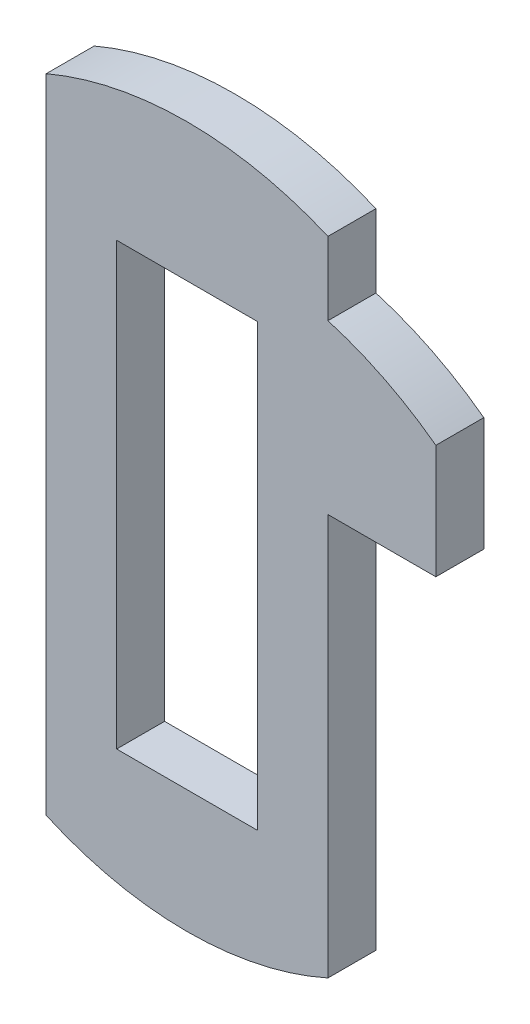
ISO-10303-21;
HEADER;
FILE_DESCRIPTION(('STEP AP214'),'2;1');
FILE_NAME('part.step','',(''),(''),'','','');
FILE_SCHEMA(('AUTOMOTIVE_DESIGN { 1 0 10303 214 1 1 1 1 }'));
ENDSEC;
DATA;
#1=APPLICATION_CONTEXT('core data for automotive mechanical design processes');
#2=APPLICATION_PROTOCOL_DEFINITION('international standard','automotive_design',2000,#1);
#3=PRODUCT_CONTEXT('',#1,'mechanical');
#4=PRODUCT('Part','Part','',(#3));
#5=PRODUCT_RELATED_PRODUCT_CATEGORY('part','',(#4));
#6=PRODUCT_DEFINITION_FORMATION('','',#4);
#7=PRODUCT_DEFINITION_CONTEXT('part definition',#1,'design');
#8=PRODUCT_DEFINITION('design','',#6,#7);
#9=PRODUCT_DEFINITION_SHAPE('','',#8);
#10=(LENGTH_UNIT() NAMED_UNIT(*) SI_UNIT(.MILLI.,.METRE.));
#11=(NAMED_UNIT(*) PLANE_ANGLE_UNIT() SI_UNIT($,.RADIAN.));
#12=(NAMED_UNIT(*) SI_UNIT($,.STERADIAN.) SOLID_ANGLE_UNIT());
#13=UNCERTAINTY_MEASURE_WITH_UNIT(LENGTH_MEASURE(1.E-05),#10,'distance_accuracy_value','');
#14=(GEOMETRIC_REPRESENTATION_CONTEXT(3) GLOBAL_UNCERTAINTY_ASSIGNED_CONTEXT((#13)) GLOBAL_UNIT_ASSIGNED_CONTEXT((#10,
#11,#12)) REPRESENTATION_CONTEXT('',''));
#15=CARTESIAN_POINT('',(0.,0.,0.));
#16=DIRECTION('',(0.,0.,1.));
#17=DIRECTION('',(1.,0.,0.));
#18=AXIS2_PLACEMENT_3D('',#15,#16,#17);
#19=CARTESIAN_POINT('',(0.,0.,0.4));
#20=DIRECTION('',(0.,0.,1.));
#21=DIRECTION('',(1.,0.,0.));
#22=AXIS2_PLACEMENT_3D('',#19,#20,#21);
#23=PLANE('',#22);
#24=DIRECTION('',(0.,1.,0.));
#25=VECTOR('',#24,1.);
#26=CARTESIAN_POINT('',(1.175,3.675,0.4));
#27=LINE('',#26,#25);
#28=CARTESIAN_POINT('',(1.175,-3.675,0.4));
#29=VERTEX_POINT('',#28);
#30=CARTESIAN_POINT('',(1.175,3.675,0.4));
#31=VERTEX_POINT('',#30);
#32=EDGE_CURVE('E205',#29,#31,#27,.T.);
#33=ORIENTED_EDGE('',*,*,#32,.F.);
#34=DIRECTION('',(1.,0.,0.));
#35=VECTOR('',#34,1.);
#36=CARTESIAN_POINT('',(1.175,-3.675,0.4));
#37=LINE('',#36,#35);
#38=CARTESIAN_POINT('',(-1.175,-3.675,0.4));
#39=VERTEX_POINT('',#38);
#40=EDGE_CURVE('E201',#39,#29,#37,.T.);
#41=ORIENTED_EDGE('',*,*,#40,.F.);
#42=DIRECTION('',(0.,1.,0.));
#43=VECTOR('',#42,1.);
#44=CARTESIAN_POINT('',(-1.175,-3.675,0.4));
#45=LINE('',#44,#43);
#46=CARTESIAN_POINT('',(-1.175,3.675,0.4));
#47=VERTEX_POINT('',#46);
#48=EDGE_CURVE('E194',#47,#39,#45,.F.);
#49=ORIENTED_EDGE('',*,*,#48,.F.);
#50=DIRECTION('',(1.,0.,0.));
#51=VECTOR('',#50,1.);
#52=CARTESIAN_POINT('',(-1.175,3.675,0.4));
#53=LINE('',#52,#51);
#54=EDGE_CURVE('E207',#31,#47,#53,.F.);
#55=ORIENTED_EDGE('',*,*,#54,.F.);
#56=EDGE_LOOP('',(#33,#41,#49,#55));
#57=FACE_BOUND('',#56,.T.);
#58=CARTESIAN_POINT('',(0.,0.,0.4));
#59=DIRECTION('',(0.,0.,1.));
#60=DIRECTION('',(1.,0.,0.));
#61=AXIS2_PLACEMENT_3D('',#58,#59,#60);
#62=CIRCLE('',#61,5.975);
#63=CARTESIAN_POINT('',(-2.35,5.493462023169,0.4));
#64=VERTEX_POINT('',#63);
#65=CARTESIAN_POINT('',(2.35,5.493462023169,0.4));
#66=VERTEX_POINT('',#65);
#67=EDGE_CURVE('E172',#64,#66,#62,.F.);
#68=ORIENTED_EDGE('',*,*,#67,.F.);
#69=DIRECTION('',(0.,1.,0.));
#70=VECTOR('',#69,1.);
#71=CARTESIAN_POINT('',(-2.35,5.493462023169,0.4));
#72=LINE('',#71,#70);
#73=CARTESIAN_POINT('',(-2.35000000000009,-5.22045256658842,0.4));
#74=VERTEX_POINT('',#73);
#75=EDGE_CURVE('E145',#74,#64,#72,.T.);
#76=ORIENTED_EDGE('',*,*,#75,.F.);
#77=CARTESIAN_POINT('',(0.,0.,0.4));
#78=DIRECTION('',(0.,0.,1.));
#79=DIRECTION('',(1.,0.,0.));
#80=AXIS2_PLACEMENT_3D('',#77,#78,#79);
#81=CIRCLE('',#80,5.725);
#82=CARTESIAN_POINT('',(2.35000000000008,-5.22045256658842,0.4));
#83=VERTEX_POINT('',#82);
#84=EDGE_CURVE('E169',#83,#74,#81,.F.);
#85=ORIENTED_EDGE('',*,*,#84,.F.);
#86=DIRECTION('',(0.,1.,0.));
#87=VECTOR('',#86,1.);
#88=CARTESIAN_POINT('',(2.35,-5.220452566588,0.4));
#89=LINE('',#88,#87);
#90=CARTESIAN_POINT('',(2.35,1.475,0.4));
#91=VERTEX_POINT('',#90);
#92=EDGE_CURVE('E149',#91,#83,#89,.F.);
#93=ORIENTED_EDGE('',*,*,#92,.F.);
#94=DIRECTION('',(1.,0.,0.));
#95=VECTOR('',#94,1.);
#96=CARTESIAN_POINT('',(2.35,1.475,0.4));
#97=LINE('',#96,#95);
#98=CARTESIAN_POINT('',(4.15,1.475,0.4));
#99=VERTEX_POINT('',#98);
#100=EDGE_CURVE('E119',#99,#91,#97,.F.);
#101=ORIENTED_EDGE('',*,*,#100,.F.);
#102=DIRECTION('',(0.,1.,0.));
#103=VECTOR('',#102,1.);
#104=CARTESIAN_POINT('',(4.15,1.475,0.4));
#105=LINE('',#104,#103);
#106=CARTESIAN_POINT('',(4.14999999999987,3.37499999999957,0.4));
#107=VERTEX_POINT('',#106);
#108=EDGE_CURVE('E116',#107,#99,#105,.F.);
#109=ORIENTED_EDGE('',*,*,#108,.F.);
#110=CARTESIAN_POINT('',(0.7295585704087,-1.215882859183,0.4));
#111=DIRECTION('',(0.,0.,1.));
#112=DIRECTION('',(1.,0.,0.));
#113=AXIS2_PLACEMENT_3D('',#110,#111,#112);
#114=CIRCLE('',#113,5.725);
#115=CARTESIAN_POINT('',(2.35,4.27499999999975,0.4));
#116=VERTEX_POINT('',#115);
#117=EDGE_CURVE('E19',#116,#107,#114,.F.);
#118=ORIENTED_EDGE('',*,*,#117,.F.);
#119=DIRECTION('',(0.,1.,0.));
#120=VECTOR('',#119,1.);
#121=CARTESIAN_POINT('',(2.35,4.275,0.4));
#122=LINE('',#121,#120);
#123=EDGE_CURVE('E101',#66,#116,#122,.F.);
#124=ORIENTED_EDGE('',*,*,#123,.F.);
#125=EDGE_LOOP('',(#68,#76,#85,#93,#101,#109,#118,#124));
#126=FACE_BOUND('',#125,.T.);
#127=ADVANCED_FACE('F16',(#57,#126),#23,.T.);
#128=CARTESIAN_POINT('',(2.35,-5.220452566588,-0.4));
#129=DIRECTION('',(1.,0.,0.));
#130=DIRECTION('',(0.,0.,-1.));
#131=AXIS2_PLACEMENT_3D('',#128,#129,#130);
#132=PLANE('',#131);
#133=ORIENTED_EDGE('',*,*,#92,.T.);
#134=DIRECTION('',(0.,0.,1.));
#135=VECTOR('',#134,1.);
#136=CARTESIAN_POINT('',(2.35000000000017,-5.22045256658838,-0.4));
#137=LINE('',#136,#135);
#138=CARTESIAN_POINT('',(2.35000000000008,-5.22045256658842,-0.4));
#139=VERTEX_POINT('',#138);
#140=EDGE_CURVE('E171',#139,#83,#137,.T.);
#141=ORIENTED_EDGE('',*,*,#140,.F.);
#142=DIRECTION('',(0.,1.,0.));
#143=VECTOR('',#142,1.);
#144=CARTESIAN_POINT('',(2.35,0.,-0.4));
#145=LINE('',#144,#143);
#146=CARTESIAN_POINT('',(2.35,1.475,-0.4));
#147=VERTEX_POINT('',#146);
#148=EDGE_CURVE('E139',#139,#147,#145,.T.);
#149=ORIENTED_EDGE('',*,*,#148,.T.);
#150=DIRECTION('',(0.,0.,-1.));
#151=VECTOR('',#150,1.);
#152=CARTESIAN_POINT('',(2.35,1.475,-0.4));
#153=LINE('',#152,#151);
#154=EDGE_CURVE('E122',#91,#147,#153,.T.);
#155=ORIENTED_EDGE('',*,*,#154,.F.);
#156=EDGE_LOOP('',(#133,#141,#149,#155));
#157=FACE_BOUND('',#156,.T.);
#158=ADVANCED_FACE('F259',(#157),#132,.T.);
#159=CARTESIAN_POINT('',(2.35,1.475,-0.4));
#160=DIRECTION('',(0.,-1.,0.));
#161=DIRECTION('',(0.,0.,-1.));
#162=AXIS2_PLACEMENT_3D('',#159,#160,#161);
#163=PLANE('',#162);
#164=ORIENTED_EDGE('',*,*,#100,.T.);
#165=ORIENTED_EDGE('',*,*,#154,.T.);
#166=DIRECTION('',(1.,0.,0.));
#167=VECTOR('',#166,1.);
#168=CARTESIAN_POINT('',(0.,1.475,-0.4));
#169=LINE('',#168,#167);
#170=CARTESIAN_POINT('',(4.15,1.475,-0.4));
#171=VERTEX_POINT('',#170);
#172=EDGE_CURVE('E136',#147,#171,#169,.T.);
#173=ORIENTED_EDGE('',*,*,#172,.T.);
#174=DIRECTION('',(0.,0.,-1.));
#175=VECTOR('',#174,1.);
#176=CARTESIAN_POINT('',(4.15,1.475,-0.4));
#177=LINE('',#176,#175);
#178=EDGE_CURVE('E114',#99,#171,#177,.T.);
#179=ORIENTED_EDGE('',*,*,#178,.F.);
#180=EDGE_LOOP('',(#164,#165,#173,#179));
#181=FACE_BOUND('',#180,.T.);
#182=ADVANCED_FACE('F262',(#181),#163,.T.);
#183=CARTESIAN_POINT('',(4.15,1.475,-0.4));
#184=DIRECTION('',(1.,0.,0.));
#185=DIRECTION('',(0.,0.,-1.));
#186=AXIS2_PLACEMENT_3D('',#183,#184,#185);
#187=PLANE('',#186);
#188=ORIENTED_EDGE('',*,*,#108,.T.);
#189=ORIENTED_EDGE('',*,*,#178,.T.);
#190=DIRECTION('',(0.,1.,0.));
#191=VECTOR('',#190,1.);
#192=CARTESIAN_POINT('',(4.15,0.,-0.4));
#193=LINE('',#192,#191);
#194=CARTESIAN_POINT('',(4.14999999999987,3.37499999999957,-0.4));
#195=VERTEX_POINT('',#194);
#196=EDGE_CURVE('E127',#171,#195,#193,.T.);
#197=ORIENTED_EDGE('',*,*,#196,.T.);
#198=DIRECTION('',(0.,0.,1.));
#199=VECTOR('',#198,1.);
#200=CARTESIAN_POINT('',(4.14999999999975,3.37499999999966,-0.4));
#201=LINE('',#200,#199);
#202=EDGE_CURVE('E110',#107,#195,#201,.F.);
#203=ORIENTED_EDGE('',*,*,#202,.F.);
#204=EDGE_LOOP('',(#188,#189,#197,#203));
#205=FACE_BOUND('',#204,.T.);
#206=ADVANCED_FACE('F125',(#205),#187,.T.);
#207=CARTESIAN_POINT('',(0.7295585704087,-1.215882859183,-0.4));
#208=DIRECTION('',(0.,0.,1.));
#209=DIRECTION('',(1.,0.,0.));
#210=AXIS2_PLACEMENT_3D('',#207,#208,#209);
#211=CYLINDRICAL_SURFACE('',#210,5.725);
#212=ORIENTED_EDGE('',*,*,#117,.T.);
#213=ORIENTED_EDGE('',*,*,#202,.T.);
#214=CARTESIAN_POINT('',(0.7295585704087,-1.215882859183,-0.4));
#215=DIRECTION('',(0.,0.,1.));
#216=DIRECTION('',(1.,0.,0.));
#217=AXIS2_PLACEMENT_3D('',#214,#215,#216);
#218=CIRCLE('',#217,5.725);
#219=CARTESIAN_POINT('',(2.35,4.27499999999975,-0.4));
#220=VERTEX_POINT('',#219);
#221=EDGE_CURVE('E167',#195,#220,#218,.T.);
#222=ORIENTED_EDGE('',*,*,#221,.T.);
#223=DIRECTION('',(0.,0.,-1.));
#224=VECTOR('',#223,1.);
#225=CARTESIAN_POINT('',(2.35,4.275,-0.4));
#226=LINE('',#225,#224);
#227=EDGE_CURVE('E112',#116,#220,#226,.T.);
#228=ORIENTED_EDGE('',*,*,#227,.F.);
#229=EDGE_LOOP('',(#212,#213,#222,#228));
#230=FACE_BOUND('',#229,.T.);
#231=ADVANCED_FACE('F107',(#230),#211,.T.);
#232=CARTESIAN_POINT('',(2.35,4.275,-0.4));
#233=DIRECTION('',(1.,0.,0.));
#234=DIRECTION('',(0.,0.,-1.));
#235=AXIS2_PLACEMENT_3D('',#232,#233,#234);
#236=PLANE('',#235);
#237=ORIENTED_EDGE('',*,*,#123,.T.);
#238=ORIENTED_EDGE('',*,*,#227,.T.);
#239=DIRECTION('',(0.,1.,0.));
#240=VECTOR('',#239,1.);
#241=CARTESIAN_POINT('',(2.35,0.,-0.4));
#242=LINE('',#241,#240);
#243=CARTESIAN_POINT('',(2.35,5.493462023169,-0.4));
#244=VERTEX_POINT('',#243);
#245=EDGE_CURVE('E166',#220,#244,#242,.T.);
#246=ORIENTED_EDGE('',*,*,#245,.T.);
#247=DIRECTION('',(0.,0.,1.));
#248=VECTOR('',#247,1.);
#249=CARTESIAN_POINT('',(2.35,5.493462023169,-0.4));
#250=LINE('',#249,#248);
#251=EDGE_CURVE('E148',#66,#244,#250,.F.);
#252=ORIENTED_EDGE('',*,*,#251,.F.);
#253=EDGE_LOOP('',(#237,#238,#246,#252));
#254=FACE_BOUND('',#253,.T.);
#255=ADVANCED_FACE('F177',(#254),#236,.T.);
#256=CARTESIAN_POINT('',(0.,0.,-0.4));
#257=DIRECTION('',(0.,0.,1.));
#258=DIRECTION('',(1.,0.,0.));
#259=AXIS2_PLACEMENT_3D('',#256,#257,#258);
#260=CYLINDRICAL_SURFACE('',#259,5.975);
#261=ORIENTED_EDGE('',*,*,#67,.T.);
#262=ORIENTED_EDGE('',*,*,#251,.T.);
#263=CARTESIAN_POINT('',(0.,0.,-0.4));
#264=DIRECTION('',(0.,0.,1.));
#265=DIRECTION('',(1.,0.,0.));
#266=AXIS2_PLACEMENT_3D('',#263,#264,#265);
#267=CIRCLE('',#266,5.975);
#268=CARTESIAN_POINT('',(-2.35,5.493462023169,-0.4));
#269=VERTEX_POINT('',#268);
#270=EDGE_CURVE('E163',#244,#269,#267,.T.);
#271=ORIENTED_EDGE('',*,*,#270,.T.);
#272=DIRECTION('',(0.,0.,1.));
#273=VECTOR('',#272,1.);
#274=CARTESIAN_POINT('',(-2.35,5.493462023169,-0.4));
#275=LINE('',#274,#273);
#276=EDGE_CURVE('E147',#64,#269,#275,.F.);
#277=ORIENTED_EDGE('',*,*,#276,.F.);
#278=EDGE_LOOP('',(#261,#262,#271,#277));
#279=FACE_BOUND('',#278,.T.);
#280=ADVANCED_FACE('F218',(#279),#260,.T.);
#281=CARTESIAN_POINT('',(-2.35,5.493462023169,-0.4));
#282=DIRECTION('',(-1.,0.,0.));
#283=DIRECTION('',(0.,0.,1.));
#284=AXIS2_PLACEMENT_3D('',#281,#282,#283);
#285=PLANE('',#284);
#286=ORIENTED_EDGE('',*,*,#75,.T.);
#287=ORIENTED_EDGE('',*,*,#276,.T.);
#288=DIRECTION('',(0.,1.,0.));
#289=VECTOR('',#288,1.);
#290=CARTESIAN_POINT('',(-2.35,0.,-0.4));
#291=LINE('',#290,#289);
#292=CARTESIAN_POINT('',(-2.35000000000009,-5.22045256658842,-0.4));
#293=VERTEX_POINT('',#292);
#294=EDGE_CURVE('E162',#269,#293,#291,.F.);
#295=ORIENTED_EDGE('',*,*,#294,.T.);
#296=DIRECTION('',(0.,0.,1.));
#297=VECTOR('',#296,1.);
#298=CARTESIAN_POINT('',(-2.35000000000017,-5.22045256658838,-0.4));
#299=LINE('',#298,#297);
#300=EDGE_CURVE('E170',#74,#293,#299,.F.);
#301=ORIENTED_EDGE('',*,*,#300,.F.);
#302=EDGE_LOOP('',(#286,#287,#295,#301));
#303=FACE_BOUND('',#302,.T.);
#304=ADVANCED_FACE('F214',(#303),#285,.T.);
#305=CARTESIAN_POINT('',(0.,0.,-0.4));
#306=DIRECTION('',(0.,0.,1.));
#307=DIRECTION('',(1.,0.,0.));
#308=AXIS2_PLACEMENT_3D('',#305,#306,#307);
#309=CYLINDRICAL_SURFACE('',#308,5.725);
#310=ORIENTED_EDGE('',*,*,#84,.T.);
#311=ORIENTED_EDGE('',*,*,#300,.T.);
#312=CARTESIAN_POINT('',(0.,0.,-0.4));
#313=DIRECTION('',(0.,0.,1.));
#314=DIRECTION('',(1.,0.,0.));
#315=AXIS2_PLACEMENT_3D('',#312,#313,#314);
#316=CIRCLE('',#315,5.725);
#317=EDGE_CURVE('E158',#293,#139,#316,.T.);
#318=ORIENTED_EDGE('',*,*,#317,.T.);
#319=ORIENTED_EDGE('',*,*,#140,.T.);
#320=EDGE_LOOP('',(#310,#311,#318,#319));
#321=FACE_BOUND('',#320,.T.);
#322=ADVANCED_FACE('F226',(#321),#309,.T.);
#323=CARTESIAN_POINT('',(-1.175,3.675,-0.4));
#324=DIRECTION('',(0.,-1.,0.));
#325=DIRECTION('',(0.,0.,-1.));
#326=AXIS2_PLACEMENT_3D('',#323,#324,#325);
#327=PLANE('',#326);
#328=ORIENTED_EDGE('',*,*,#54,.T.);
#329=DIRECTION('',(0.,0.,-1.));
#330=VECTOR('',#329,1.);
#331=CARTESIAN_POINT('',(-1.175,3.675,-0.4));
#332=LINE('',#331,#330);
#333=CARTESIAN_POINT('',(-1.175,3.675,-0.4));
#334=VERTEX_POINT('',#333);
#335=EDGE_CURVE('E196',#334,#47,#332,.F.);
#336=ORIENTED_EDGE('',*,*,#335,.F.);
#337=DIRECTION('',(1.,0.,0.));
#338=VECTOR('',#337,1.);
#339=CARTESIAN_POINT('',(0.,3.675,-0.4));
#340=LINE('',#339,#338);
#341=CARTESIAN_POINT('',(1.175,3.675,-0.4));
#342=VERTEX_POINT('',#341);
#343=EDGE_CURVE('E161',#334,#342,#340,.T.);
#344=ORIENTED_EDGE('',*,*,#343,.T.);
#345=DIRECTION('',(0.,0.,1.));
#346=VECTOR('',#345,1.);
#347=CARTESIAN_POINT('',(1.175,3.675,-0.4));
#348=LINE('',#347,#346);
#349=EDGE_CURVE('E203',#31,#342,#348,.F.);
#350=ORIENTED_EDGE('',*,*,#349,.F.);
#351=EDGE_LOOP('',(#328,#336,#344,#350));
#352=FACE_BOUND('',#351,.T.);
#353=ADVANCED_FACE('F246',(#352),#327,.T.);
#354=CARTESIAN_POINT('',(1.175,3.675,-0.4));
#355=DIRECTION('',(-1.,0.,0.));
#356=DIRECTION('',(0.,0.,1.));
#357=AXIS2_PLACEMENT_3D('',#354,#355,#356);
#358=PLANE('',#357);
#359=ORIENTED_EDGE('',*,*,#32,.T.);
#360=ORIENTED_EDGE('',*,*,#349,.T.);
#361=DIRECTION('',(0.,1.,0.));
#362=VECTOR('',#361,1.);
#363=CARTESIAN_POINT('',(1.175,0.,-0.4));
#364=LINE('',#363,#362);
#365=CARTESIAN_POINT('',(1.175,-3.675,-0.4));
#366=VERTEX_POINT('',#365);
#367=EDGE_CURVE('E335',#342,#366,#364,.F.);
#368=ORIENTED_EDGE('',*,*,#367,.T.);
#369=DIRECTION('',(0.,0.,1.));
#370=VECTOR('',#369,1.);
#371=CARTESIAN_POINT('',(1.175,-3.675,-0.4));
#372=LINE('',#371,#370);
#373=EDGE_CURVE('E199',#29,#366,#372,.F.);
#374=ORIENTED_EDGE('',*,*,#373,.F.);
#375=EDGE_LOOP('',(#359,#360,#368,#374));
#376=FACE_BOUND('',#375,.T.);
#377=ADVANCED_FACE('F242',(#376),#358,.T.);
#378=CARTESIAN_POINT('',(1.175,-3.675,-0.4));
#379=DIRECTION('',(0.,1.,0.));
#380=DIRECTION('',(0.,0.,1.));
#381=AXIS2_PLACEMENT_3D('',#378,#379,#380);
#382=PLANE('',#381);
#383=ORIENTED_EDGE('',*,*,#40,.T.);
#384=ORIENTED_EDGE('',*,*,#373,.T.);
#385=DIRECTION('',(1.,0.,0.));
#386=VECTOR('',#385,1.);
#387=CARTESIAN_POINT('',(0.,-3.675,-0.4));
#388=LINE('',#387,#386);
#389=CARTESIAN_POINT('',(-1.175,-3.675,-0.4));
#390=VERTEX_POINT('',#389);
#391=EDGE_CURVE('E25',#366,#390,#388,.F.);
#392=ORIENTED_EDGE('',*,*,#391,.T.);
#393=DIRECTION('',(0.,0.,-1.));
#394=VECTOR('',#393,1.);
#395=CARTESIAN_POINT('',(-1.175,-3.675,-0.4));
#396=LINE('',#395,#394);
#397=EDGE_CURVE('E33',#39,#390,#396,.T.);
#398=ORIENTED_EDGE('',*,*,#397,.F.);
#399=EDGE_LOOP('',(#383,#384,#392,#398));
#400=FACE_BOUND('',#399,.T.);
#401=ADVANCED_FACE('F236',(#400),#382,.T.);
#402=CARTESIAN_POINT('',(-1.175,-3.675,-0.4));
#403=DIRECTION('',(1.,0.,0.));
#404=DIRECTION('',(0.,0.,-1.));
#405=AXIS2_PLACEMENT_3D('',#402,#403,#404);
#406=PLANE('',#405);
#407=ORIENTED_EDGE('',*,*,#48,.T.);
#408=ORIENTED_EDGE('',*,*,#397,.T.);
#409=DIRECTION('',(0.,1.,0.));
#410=VECTOR('',#409,1.);
#411=CARTESIAN_POINT('',(-1.175,0.,-0.4));
#412=LINE('',#411,#410);
#413=EDGE_CURVE('E11',#390,#334,#412,.T.);
#414=ORIENTED_EDGE('',*,*,#413,.T.);
#415=ORIENTED_EDGE('',*,*,#335,.T.);
#416=EDGE_LOOP('',(#407,#408,#414,#415));
#417=FACE_BOUND('',#416,.T.);
#418=ADVANCED_FACE('F230',(#417),#406,.T.);
#419=CARTESIAN_POINT('',(0.,0.,-0.4));
#420=DIRECTION('',(0.,0.,1.));
#421=DIRECTION('',(1.,0.,0.));
#422=AXIS2_PLACEMENT_3D('',#419,#420,#421);
#423=PLANE('',#422);
#424=ORIENTED_EDGE('',*,*,#391,.F.);
#425=ORIENTED_EDGE('',*,*,#367,.F.);
#426=ORIENTED_EDGE('',*,*,#343,.F.);
#427=ORIENTED_EDGE('',*,*,#413,.F.);
#428=EDGE_LOOP('',(#424,#425,#426,#427));
#429=FACE_BOUND('',#428,.T.);
#430=ORIENTED_EDGE('',*,*,#294,.F.);
#431=ORIENTED_EDGE('',*,*,#270,.F.);
#432=ORIENTED_EDGE('',*,*,#245,.F.);
#433=ORIENTED_EDGE('',*,*,#221,.F.);
#434=ORIENTED_EDGE('',*,*,#196,.F.);
#435=ORIENTED_EDGE('',*,*,#172,.F.);
#436=ORIENTED_EDGE('',*,*,#148,.F.);
#437=ORIENTED_EDGE('',*,*,#317,.F.);
#438=EDGE_LOOP('',(#430,#431,#432,#433,#434,#435,#436,#437));
#439=FACE_BOUND('',#438,.T.);
#440=ADVANCED_FACE('F181',(#429,#439),#423,.F.);
#441=CLOSED_SHELL('',(#127,#158,#182,#206,#231,#255,#280,#304,#322,#353,#377,#401,#418,#440));
#442=MANIFOLD_SOLID_BREP('B1',#441);
#443=ADVANCED_BREP_SHAPE_REPRESENTATION('',(#18,#442),#14);
#444=SHAPE_DEFINITION_REPRESENTATION(#9,#443);
ENDSEC;
END-ISO-10303-21;
